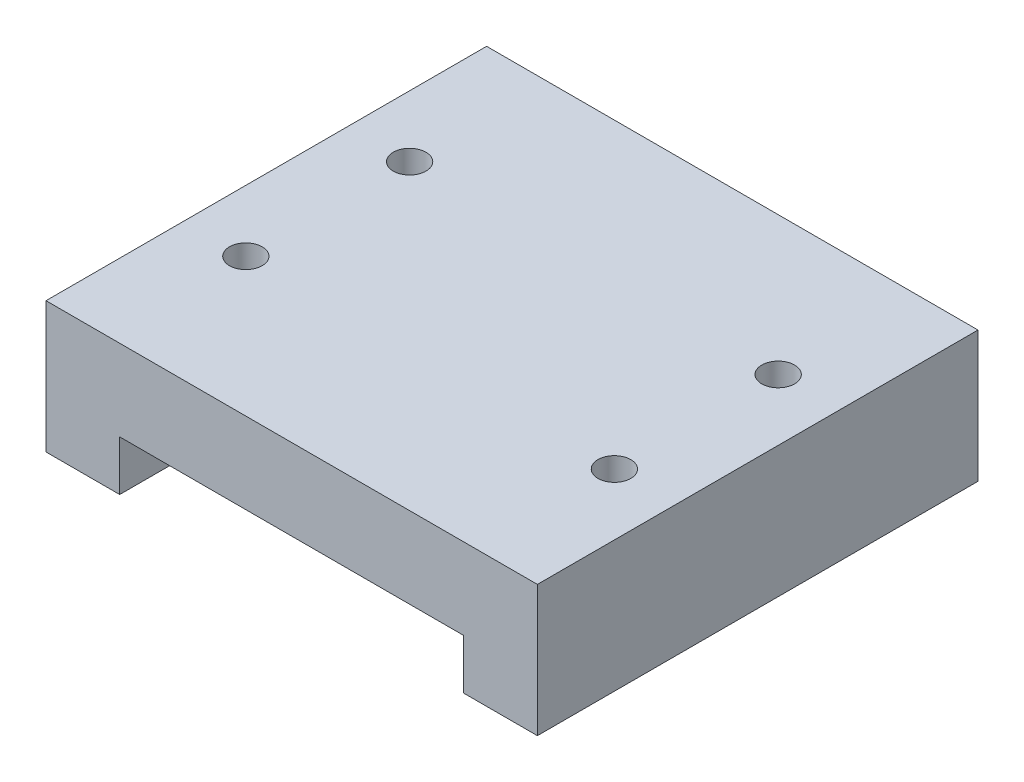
ISO-10303-21;
HEADER;
FILE_DESCRIPTION(('STEP AP214'),'2;1');
FILE_NAME('part.step','',(''),(''),'','','');
FILE_SCHEMA(('AUTOMOTIVE_DESIGN { 1 0 10303 214 1 1 1 1 }'));
ENDSEC;
DATA;
#1=APPLICATION_CONTEXT('core data for automotive mechanical design processes');
#2=APPLICATION_PROTOCOL_DEFINITION('international standard','automotive_design',2000,#1);
#3=PRODUCT_CONTEXT('',#1,'mechanical');
#4=PRODUCT('Part','Part','',(#3));
#5=PRODUCT_RELATED_PRODUCT_CATEGORY('part','',(#4));
#6=PRODUCT_DEFINITION_FORMATION('','',#4);
#7=PRODUCT_DEFINITION_CONTEXT('part definition',#1,'design');
#8=PRODUCT_DEFINITION('design','',#6,#7);
#9=PRODUCT_DEFINITION_SHAPE('','',#8);
#10=(LENGTH_UNIT() NAMED_UNIT(*) SI_UNIT(.MILLI.,.METRE.));
#11=(NAMED_UNIT(*) PLANE_ANGLE_UNIT() SI_UNIT($,.RADIAN.));
#12=(NAMED_UNIT(*) SI_UNIT($,.STERADIAN.) SOLID_ANGLE_UNIT());
#13=UNCERTAINTY_MEASURE_WITH_UNIT(LENGTH_MEASURE(1.E-05),#10,'distance_accuracy_value','');
#14=(GEOMETRIC_REPRESENTATION_CONTEXT(3) GLOBAL_UNCERTAINTY_ASSIGNED_CONTEXT((#13)) GLOBAL_UNIT_ASSIGNED_CONTEXT((#10,
#11,#12)) REPRESENTATION_CONTEXT('',''));
#15=CARTESIAN_POINT('',(0.,0.,0.));
#16=DIRECTION('',(0.,0.,1.));
#17=DIRECTION('',(1.,0.,0.));
#18=AXIS2_PLACEMENT_3D('',#15,#16,#17);
#19=CARTESIAN_POINT('',(21.,0.,53.8));
#20=DIRECTION('',(-1.,0.,0.));
#21=DIRECTION('',(0.,-1.,0.));
#22=AXIS2_PLACEMENT_3D('',#19,#20,#21);
#23=PLANE('',#22);
#24=DIRECTION('',(0.,1.,0.));
#25=VECTOR('',#24,1.);
#26=CARTESIAN_POINT('',(21.,0.,0.));
#27=LINE('',#26,#25);
#28=CARTESIAN_POINT('',(21.,-8.,0.));
#29=VERTEX_POINT('',#28);
#30=CARTESIAN_POINT('',(21.,-1.89999999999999,0.));
#31=VERTEX_POINT('',#30);
#32=EDGE_CURVE('E133',#29,#31,#27,.T.);
#33=ORIENTED_EDGE('',*,*,#32,.F.);
#34=DIRECTION('',(0.,0.,-1.));
#35=VECTOR('',#34,1.);
#36=CARTESIAN_POINT('',(21.,-8.,53.8));
#37=LINE('',#36,#35);
#38=CARTESIAN_POINT('',(21.,-8.,53.8));
#39=VERTEX_POINT('',#38);
#40=EDGE_CURVE('E11',#39,#29,#37,.T.);
#41=ORIENTED_EDGE('',*,*,#40,.F.);
#42=DIRECTION('',(0.,1.,0.));
#43=VECTOR('',#42,1.);
#44=CARTESIAN_POINT('',(21.,0.,53.8));
#45=LINE('',#44,#43);
#46=CARTESIAN_POINT('',(21.,-1.89999999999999,53.8));
#47=VERTEX_POINT('',#46);
#48=EDGE_CURVE('E151',#39,#47,#45,.T.);
#49=ORIENTED_EDGE('',*,*,#48,.T.);
#50=DIRECTION('',(0.,0.,-1.));
#51=VECTOR('',#50,1.);
#52=CARTESIAN_POINT('',(21.,-1.89999999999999,53.8));
#53=LINE('',#52,#51);
#54=EDGE_CURVE('E88',#47,#31,#53,.T.);
#55=ORIENTED_EDGE('',*,*,#54,.T.);
#56=EDGE_LOOP('',(#33,#41,#49,#55));
#57=FACE_BOUND('',#56,.T.);
#58=ADVANCED_FACE('F37',(#57),#23,.T.);
#59=CARTESIAN_POINT('',(0.,-8.,53.8));
#60=DIRECTION('',(0.,1.,0.));
#61=DIRECTION('',(0.,0.,1.));
#62=AXIS2_PLACEMENT_3D('',#59,#60,#61);
#63=PLANE('',#62);
#64=DIRECTION('',(1.,0.,0.));
#65=VECTOR('',#64,1.);
#66=CARTESIAN_POINT('',(0.,-8.,0.));
#67=LINE('',#66,#65);
#68=CARTESIAN_POINT('',(30.,-8.,0.));
#69=VERTEX_POINT('',#68);
#70=EDGE_CURVE('E136',#29,#69,#67,.T.);
#71=ORIENTED_EDGE('',*,*,#70,.T.);
#72=DIRECTION('',(0.,0.,-1.));
#73=VECTOR('',#72,1.);
#74=CARTESIAN_POINT('',(30.,-8.,53.8));
#75=LINE('',#74,#73);
#76=CARTESIAN_POINT('',(30.,-8.,53.8));
#77=VERTEX_POINT('',#76);
#78=EDGE_CURVE('E45',#77,#69,#75,.T.);
#79=ORIENTED_EDGE('',*,*,#78,.F.);
#80=DIRECTION('',(1.,0.,0.));
#81=VECTOR('',#80,1.);
#82=CARTESIAN_POINT('',(0.,-8.,53.8));
#83=LINE('',#82,#81);
#84=EDGE_CURVE('E119',#39,#77,#83,.T.);
#85=ORIENTED_EDGE('',*,*,#84,.F.);
#86=ORIENTED_EDGE('',*,*,#40,.T.);
#87=EDGE_LOOP('',(#71,#79,#85,#86));
#88=FACE_BOUND('',#87,.T.);
#89=ADVANCED_FACE('F167',(#88),#63,.F.);
#90=CARTESIAN_POINT('',(30.,0.,53.8));
#91=DIRECTION('',(1.,0.,0.));
#92=DIRECTION('',(0.,1.,0.));
#93=AXIS2_PLACEMENT_3D('',#90,#91,#92);
#94=PLANE('',#93);
#95=DIRECTION('',(0.,-1.,0.));
#96=VECTOR('',#95,1.);
#97=CARTESIAN_POINT('',(30.,0.,0.));
#98=LINE('',#97,#96);
#99=CARTESIAN_POINT('',(30.,8.,0.));
#100=VERTEX_POINT('',#99);
#101=EDGE_CURVE('E140',#100,#69,#98,.T.);
#102=ORIENTED_EDGE('',*,*,#101,.F.);
#103=DIRECTION('',(0.,0.,-1.));
#104=VECTOR('',#103,1.);
#105=CARTESIAN_POINT('',(30.,8.,53.8));
#106=LINE('',#105,#104);
#107=CARTESIAN_POINT('',(30.,8.,53.8));
#108=VERTEX_POINT('',#107);
#109=EDGE_CURVE('E157',#108,#100,#106,.T.);
#110=ORIENTED_EDGE('',*,*,#109,.F.);
#111=DIRECTION('',(0.,-1.,0.));
#112=VECTOR('',#111,1.);
#113=CARTESIAN_POINT('',(30.,0.,53.8));
#114=LINE('',#113,#112);
#115=EDGE_CURVE('E164',#108,#77,#114,.T.);
#116=ORIENTED_EDGE('',*,*,#115,.T.);
#117=ORIENTED_EDGE('',*,*,#78,.T.);
#118=EDGE_LOOP('',(#102,#110,#116,#117));
#119=FACE_BOUND('',#118,.T.);
#120=ADVANCED_FACE('F162',(#119),#94,.T.);
#121=CARTESIAN_POINT('',(0.,8.,53.8));
#122=DIRECTION('',(0.,1.,0.));
#123=DIRECTION('',(0.,0.,1.));
#124=AXIS2_PLACEMENT_3D('',#121,#122,#123);
#125=PLANE('',#124);
#126=CARTESIAN_POINT('',(22.5,8.,16.9));
#127=DIRECTION('',(0.,1.,0.));
#128=DIRECTION('',(0.,0.,-1.));
#129=AXIS2_PLACEMENT_3D('',#126,#127,#128);
#130=CIRCLE('',#129,2.);
#131=CARTESIAN_POINT('',(22.5,8.,14.9));
#132=VERTEX_POINT('',#131);
#133=EDGE_CURVE('E188',#132,#132,#130,.T.);
#134=ORIENTED_EDGE('',*,*,#133,.F.);
#135=EDGE_LOOP('',(#134));
#136=FACE_BOUND('',#135,.T.);
#137=CARTESIAN_POINT('',(22.5,8.,36.9));
#138=DIRECTION('',(0.,1.,0.));
#139=DIRECTION('',(0.,0.,1.));
#140=AXIS2_PLACEMENT_3D('',#137,#138,#139);
#141=CIRCLE('',#140,2.);
#142=CARTESIAN_POINT('',(22.5,8.,38.9));
#143=VERTEX_POINT('',#142);
#144=EDGE_CURVE('E194',#143,#143,#141,.T.);
#145=ORIENTED_EDGE('',*,*,#144,.F.);
#146=EDGE_LOOP('',(#145));
#147=FACE_BOUND('',#146,.T.);
#148=CARTESIAN_POINT('',(-22.5,8.,36.9));
#149=DIRECTION('',(0.,1.,0.));
#150=DIRECTION('',(0.,0.,-1.));
#151=AXIS2_PLACEMENT_3D('',#148,#149,#150);
#152=CIRCLE('',#151,2.);
#153=CARTESIAN_POINT('',(-22.5,8.,34.9));
#154=VERTEX_POINT('',#153);
#155=EDGE_CURVE('E182',#154,#154,#152,.T.);
#156=ORIENTED_EDGE('',*,*,#155,.F.);
#157=EDGE_LOOP('',(#156));
#158=FACE_BOUND('',#157,.T.);
#159=CARTESIAN_POINT('',(-22.5,8.,16.9));
#160=DIRECTION('',(0.,1.,0.));
#161=DIRECTION('',(0.,0.,1.));
#162=AXIS2_PLACEMENT_3D('',#159,#160,#161);
#163=CIRCLE('',#162,2.);
#164=CARTESIAN_POINT('',(-22.5,8.,18.9));
#165=VERTEX_POINT('',#164);
#166=EDGE_CURVE('E179',#165,#165,#163,.T.);
#167=ORIENTED_EDGE('',*,*,#166,.F.);
#168=EDGE_LOOP('',(#167));
#169=FACE_BOUND('',#168,.T.);
#170=DIRECTION('',(1.,0.,0.));
#171=VECTOR('',#170,1.);
#172=CARTESIAN_POINT('',(0.,8.,0.));
#173=LINE('',#172,#171);
#174=CARTESIAN_POINT('',(-30.,8.,0.));
#175=VERTEX_POINT('',#174);
#176=EDGE_CURVE('E143',#175,#100,#173,.T.);
#177=ORIENTED_EDGE('',*,*,#176,.F.);
#178=DIRECTION('',(0.,0.,-1.));
#179=VECTOR('',#178,1.);
#180=CARTESIAN_POINT('',(-30.,8.,53.8));
#181=LINE('',#180,#179);
#182=CARTESIAN_POINT('',(-30.,8.,53.8));
#183=VERTEX_POINT('',#182);
#184=EDGE_CURVE('E155',#183,#175,#181,.T.);
#185=ORIENTED_EDGE('',*,*,#184,.F.);
#186=DIRECTION('',(1.,0.,0.));
#187=VECTOR('',#186,1.);
#188=CARTESIAN_POINT('',(0.,8.,53.8));
#189=LINE('',#188,#187);
#190=EDGE_CURVE('E175',#183,#108,#189,.T.);
#191=ORIENTED_EDGE('',*,*,#190,.T.);
#192=ORIENTED_EDGE('',*,*,#109,.T.);
#193=EDGE_LOOP('',(#177,#185,#191,#192));
#194=FACE_BOUND('',#193,.T.);
#195=ADVANCED_FACE('F173',(#136,#147,#158,#169,#194),#125,.T.);
#196=CARTESIAN_POINT('',(-30.,0.,53.8));
#197=DIRECTION('',(1.,0.,0.));
#198=DIRECTION('',(0.,1.,0.));
#199=AXIS2_PLACEMENT_3D('',#196,#197,#198);
#200=PLANE('',#199);
#201=DIRECTION('',(0.,-1.,0.));
#202=VECTOR('',#201,1.);
#203=CARTESIAN_POINT('',(-30.,0.,0.));
#204=LINE('',#203,#202);
#205=CARTESIAN_POINT('',(-30.,-8.,0.));
#206=VERTEX_POINT('',#205);
#207=EDGE_CURVE('E146',#175,#206,#204,.T.);
#208=ORIENTED_EDGE('',*,*,#207,.T.);
#209=DIRECTION('',(0.,0.,-1.));
#210=VECTOR('',#209,1.);
#211=CARTESIAN_POINT('',(-30.,-8.,53.8));
#212=LINE('',#211,#210);
#213=CARTESIAN_POINT('',(-30.,-8.,53.8));
#214=VERTEX_POINT('',#213);
#215=EDGE_CURVE('E124',#214,#206,#212,.T.);
#216=ORIENTED_EDGE('',*,*,#215,.F.);
#217=DIRECTION('',(0.,-1.,0.));
#218=VECTOR('',#217,1.);
#219=CARTESIAN_POINT('',(-30.,0.,53.8));
#220=LINE('',#219,#218);
#221=EDGE_CURVE('E114',#183,#214,#220,.T.);
#222=ORIENTED_EDGE('',*,*,#221,.F.);
#223=ORIENTED_EDGE('',*,*,#184,.T.);
#224=EDGE_LOOP('',(#208,#216,#222,#223));
#225=FACE_BOUND('',#224,.T.);
#226=ADVANCED_FACE('F207',(#225),#200,.F.);
#227=CARTESIAN_POINT('',(-21.,-8.,0.));
#228=VERTEX_POINT('',#227);
#229=EDGE_CURVE('E123',#206,#228,#67,.T.);
#230=ORIENTED_EDGE('',*,*,#229,.T.);
#231=DIRECTION('',(0.,0.,-1.));
#232=VECTOR('',#231,1.);
#233=CARTESIAN_POINT('',(-21.,-8.,53.8));
#234=LINE('',#233,#232);
#235=CARTESIAN_POINT('',(-21.,-8.,53.8));
#236=VERTEX_POINT('',#235);
#237=EDGE_CURVE('E120',#236,#228,#234,.T.);
#238=ORIENTED_EDGE('',*,*,#237,.F.);
#239=EDGE_CURVE('E107',#214,#236,#83,.T.);
#240=ORIENTED_EDGE('',*,*,#239,.F.);
#241=ORIENTED_EDGE('',*,*,#215,.T.);
#242=EDGE_LOOP('',(#230,#238,#240,#241));
#243=FACE_BOUND('',#242,.T.);
#244=ADVANCED_FACE('F121',(#243),#63,.F.);
#245=CARTESIAN_POINT('',(-21.,0.,53.8));
#246=DIRECTION('',(-1.,0.,0.));
#247=DIRECTION('',(0.,0.,1.));
#248=AXIS2_PLACEMENT_3D('',#245,#246,#247);
#249=PLANE('',#248);
#250=DIRECTION('',(0.,1.,0.));
#251=VECTOR('',#250,1.);
#252=CARTESIAN_POINT('',(-21.,0.,0.));
#253=LINE('',#252,#251);
#254=CARTESIAN_POINT('',(-21.,-1.9,0.));
#255=VERTEX_POINT('',#254);
#256=EDGE_CURVE('E81',#228,#255,#253,.T.);
#257=ORIENTED_EDGE('',*,*,#256,.T.);
#258=DIRECTION('',(0.,0.,-1.));
#259=VECTOR('',#258,1.);
#260=CARTESIAN_POINT('',(-21.,-1.9,53.8));
#261=LINE('',#260,#259);
#262=CARTESIAN_POINT('',(-21.,-1.9,53.8));
#263=VERTEX_POINT('',#262);
#264=EDGE_CURVE('E125',#263,#255,#261,.T.);
#265=ORIENTED_EDGE('',*,*,#264,.F.);
#266=DIRECTION('',(0.,1.,0.));
#267=VECTOR('',#266,1.);
#268=CARTESIAN_POINT('',(-21.,0.,53.8));
#269=LINE('',#268,#267);
#270=EDGE_CURVE('E111',#236,#263,#269,.T.);
#271=ORIENTED_EDGE('',*,*,#270,.F.);
#272=ORIENTED_EDGE('',*,*,#237,.T.);
#273=EDGE_LOOP('',(#257,#265,#271,#272));
#274=FACE_BOUND('',#273,.T.);
#275=ADVANCED_FACE('F127',(#274),#249,.F.);
#276=CARTESIAN_POINT('',(0.,-1.89999999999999,53.8));
#277=DIRECTION('',(0.,1.,0.));
#278=DIRECTION('',(-1.,0.,0.));
#279=AXIS2_PLACEMENT_3D('',#276,#277,#278);
#280=PLANE('',#279);
#281=DIRECTION('',(1.,0.,0.));
#282=VECTOR('',#281,1.);
#283=CARTESIAN_POINT('',(0.,-1.89999999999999,0.));
#284=LINE('',#283,#282);
#285=EDGE_CURVE('E149',#255,#31,#284,.T.);
#286=ORIENTED_EDGE('',*,*,#285,.T.);
#287=ORIENTED_EDGE('',*,*,#54,.F.);
#288=DIRECTION('',(1.,0.,0.));
#289=VECTOR('',#288,1.);
#290=CARTESIAN_POINT('',(0.,-1.89999999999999,53.8));
#291=LINE('',#290,#289);
#292=EDGE_CURVE('E53',#263,#47,#291,.T.);
#293=ORIENTED_EDGE('',*,*,#292,.F.);
#294=ORIENTED_EDGE('',*,*,#264,.T.);
#295=EDGE_LOOP('',(#286,#287,#293,#294));
#296=FACE_BOUND('',#295,.T.);
#297=ADVANCED_FACE('F233',(#296),#280,.F.);
#298=CARTESIAN_POINT('',(0.,0.,53.8));
#299=DIRECTION('',(0.,0.,1.));
#300=DIRECTION('',(1.,0.,0.));
#301=AXIS2_PLACEMENT_3D('',#298,#299,#300);
#302=PLANE('',#301);
#303=ORIENTED_EDGE('',*,*,#48,.F.);
#304=ORIENTED_EDGE('',*,*,#84,.T.);
#305=ORIENTED_EDGE('',*,*,#115,.F.);
#306=ORIENTED_EDGE('',*,*,#190,.F.);
#307=ORIENTED_EDGE('',*,*,#221,.T.);
#308=ORIENTED_EDGE('',*,*,#239,.T.);
#309=ORIENTED_EDGE('',*,*,#270,.T.);
#310=ORIENTED_EDGE('',*,*,#292,.T.);
#311=EDGE_LOOP('',(#303,#304,#305,#306,#307,#308,#309,#310));
#312=FACE_BOUND('',#311,.T.);
#313=ADVANCED_FACE('F109',(#312),#302,.T.);
#314=CARTESIAN_POINT('',(0.,0.,0.));
#315=DIRECTION('',(0.,0.,1.));
#316=DIRECTION('',(1.,0.,0.));
#317=AXIS2_PLACEMENT_3D('',#314,#315,#316);
#318=PLANE('',#317);
#319=ORIENTED_EDGE('',*,*,#32,.T.);
#320=ORIENTED_EDGE('',*,*,#285,.F.);
#321=ORIENTED_EDGE('',*,*,#256,.F.);
#322=ORIENTED_EDGE('',*,*,#229,.F.);
#323=ORIENTED_EDGE('',*,*,#207,.F.);
#324=ORIENTED_EDGE('',*,*,#176,.T.);
#325=ORIENTED_EDGE('',*,*,#101,.T.);
#326=ORIENTED_EDGE('',*,*,#70,.F.);
#327=EDGE_LOOP('',(#319,#320,#321,#322,#323,#324,#325,#326));
#328=FACE_BOUND('',#327,.T.);
#329=ADVANCED_FACE('F169',(#328),#318,.F.);
#330=CARTESIAN_POINT('',(-22.5,3.8,16.9));
#331=DIRECTION('',(0.,1.,0.));
#332=DIRECTION('',(0.,0.,1.));
#333=AXIS2_PLACEMENT_3D('',#330,#331,#332);
#334=CYLINDRICAL_SURFACE('',#333,2.);
#335=CARTESIAN_POINT('',(-22.5,3.8,16.9));
#336=DIRECTION('',(0.,1.,0.));
#337=DIRECTION('',(0.,0.,1.));
#338=AXIS2_PLACEMENT_3D('',#335,#336,#337);
#339=CIRCLE('',#338,2.);
#340=CARTESIAN_POINT('',(-22.5,3.8,18.9));
#341=VERTEX_POINT('',#340);
#342=EDGE_CURVE('E137',#341,#341,#339,.T.);
#343=ORIENTED_EDGE('',*,*,#342,.F.);
#344=EDGE_LOOP('',(#343));
#345=FACE_BOUND('',#344,.T.);
#346=ORIENTED_EDGE('',*,*,#166,.T.);
#347=EDGE_LOOP('',(#346));
#348=FACE_BOUND('',#347,.T.);
#349=ADVANCED_FACE('F212',(#345,#348),#334,.F.);
#350=CARTESIAN_POINT('',(-22.5,3.8,16.9));
#351=DIRECTION('',(0.,1.,0.));
#352=DIRECTION('',(0.,0.,1.));
#353=AXIS2_PLACEMENT_3D('',#350,#351,#352);
#354=PLANE('',#353);
#355=ORIENTED_EDGE('',*,*,#342,.T.);
#356=EDGE_LOOP('',(#355));
#357=FACE_BOUND('',#356,.T.);
#358=ADVANCED_FACE('F214',(#357),#354,.T.);
#359=CARTESIAN_POINT('',(-22.5,3.8,36.9));
#360=DIRECTION('',(0.,1.,0.));
#361=DIRECTION('',(0.,0.,1.));
#362=AXIS2_PLACEMENT_3D('',#359,#360,#361);
#363=CYLINDRICAL_SURFACE('',#362,2.);
#364=CARTESIAN_POINT('',(-22.5,3.8,36.9));
#365=DIRECTION('',(0.,1.,0.));
#366=DIRECTION('',(0.,0.,-1.));
#367=AXIS2_PLACEMENT_3D('',#364,#365,#366);
#368=CIRCLE('',#367,2.);
#369=CARTESIAN_POINT('',(-22.5,3.8,34.9));
#370=VERTEX_POINT('',#369);
#371=EDGE_CURVE('E197',#370,#370,#368,.T.);
#372=ORIENTED_EDGE('',*,*,#371,.F.);
#373=EDGE_LOOP('',(#372));
#374=FACE_BOUND('',#373,.T.);
#375=ORIENTED_EDGE('',*,*,#155,.T.);
#376=EDGE_LOOP('',(#375));
#377=FACE_BOUND('',#376,.T.);
#378=ADVANCED_FACE('F203',(#374,#377),#363,.F.);
#379=CARTESIAN_POINT('',(-22.5,3.8,36.9));
#380=DIRECTION('',(0.,-1.,0.));
#381=DIRECTION('',(0.,0.,-1.));
#382=AXIS2_PLACEMENT_3D('',#379,#380,#381);
#383=PLANE('',#382);
#384=ORIENTED_EDGE('',*,*,#371,.T.);
#385=EDGE_LOOP('',(#384));
#386=FACE_BOUND('',#385,.T.);
#387=ADVANCED_FACE('F311',(#386),#383,.F.);
#388=CARTESIAN_POINT('',(22.5,3.8,36.9));
#389=DIRECTION('',(0.,1.,0.));
#390=DIRECTION('',(0.,0.,1.));
#391=AXIS2_PLACEMENT_3D('',#388,#389,#390);
#392=CYLINDRICAL_SURFACE('',#391,2.);
#393=CARTESIAN_POINT('',(22.5,3.8,36.9));
#394=DIRECTION('',(0.,1.,0.));
#395=DIRECTION('',(0.,0.,1.));
#396=AXIS2_PLACEMENT_3D('',#393,#394,#395);
#397=CIRCLE('',#396,2.);
#398=CARTESIAN_POINT('',(22.5,3.8,38.9));
#399=VERTEX_POINT('',#398);
#400=EDGE_CURVE('E191',#399,#399,#397,.T.);
#401=ORIENTED_EDGE('',*,*,#400,.F.);
#402=EDGE_LOOP('',(#401));
#403=FACE_BOUND('',#402,.T.);
#404=ORIENTED_EDGE('',*,*,#144,.T.);
#405=EDGE_LOOP('',(#404));
#406=FACE_BOUND('',#405,.T.);
#407=ADVANCED_FACE('F322',(#403,#406),#392,.F.);
#408=CARTESIAN_POINT('',(22.5,3.8,36.9));
#409=DIRECTION('',(0.,1.,0.));
#410=DIRECTION('',(0.,0.,1.));
#411=AXIS2_PLACEMENT_3D('',#408,#409,#410);
#412=PLANE('',#411);
#413=ORIENTED_EDGE('',*,*,#400,.T.);
#414=EDGE_LOOP('',(#413));
#415=FACE_BOUND('',#414,.T.);
#416=ADVANCED_FACE('F333',(#415),#412,.T.);
#417=CARTESIAN_POINT('',(22.5,3.8,16.9));
#418=DIRECTION('',(0.,1.,0.));
#419=DIRECTION('',(0.,0.,1.));
#420=AXIS2_PLACEMENT_3D('',#417,#418,#419);
#421=CYLINDRICAL_SURFACE('',#420,2.);
#422=CARTESIAN_POINT('',(22.5,3.8,16.9));
#423=DIRECTION('',(0.,1.,0.));
#424=DIRECTION('',(0.,0.,-1.));
#425=AXIS2_PLACEMENT_3D('',#422,#423,#424);
#426=CIRCLE('',#425,2.);
#427=CARTESIAN_POINT('',(22.5,3.8,14.9));
#428=VERTEX_POINT('',#427);
#429=EDGE_CURVE('E185',#428,#428,#426,.T.);
#430=ORIENTED_EDGE('',*,*,#429,.F.);
#431=EDGE_LOOP('',(#430));
#432=FACE_BOUND('',#431,.T.);
#433=ORIENTED_EDGE('',*,*,#133,.T.);
#434=EDGE_LOOP('',(#433));
#435=FACE_BOUND('',#434,.T.);
#436=ADVANCED_FACE('F344',(#432,#435),#421,.F.);
#437=CARTESIAN_POINT('',(22.5,3.8,16.9));
#438=DIRECTION('',(0.,-1.,0.));
#439=DIRECTION('',(0.,0.,-1.));
#440=AXIS2_PLACEMENT_3D('',#437,#438,#439);
#441=PLANE('',#440);
#442=ORIENTED_EDGE('',*,*,#429,.T.);
#443=EDGE_LOOP('',(#442));
#444=FACE_BOUND('',#443,.T.);
#445=ADVANCED_FACE('F355',(#444),#441,.F.);
#446=CLOSED_SHELL('',(#58,#89,#120,#195,#226,#244,#275,#297,#313,#329,#349,#358,#378,#387,#407,
#416,#436,#445));
#447=MANIFOLD_SOLID_BREP('B2',#446);
#448=ADVANCED_BREP_SHAPE_REPRESENTATION('',(#18,#447),#14);
#449=SHAPE_DEFINITION_REPRESENTATION(#9,#448);
ENDSEC;
END-ISO-10303-21;
